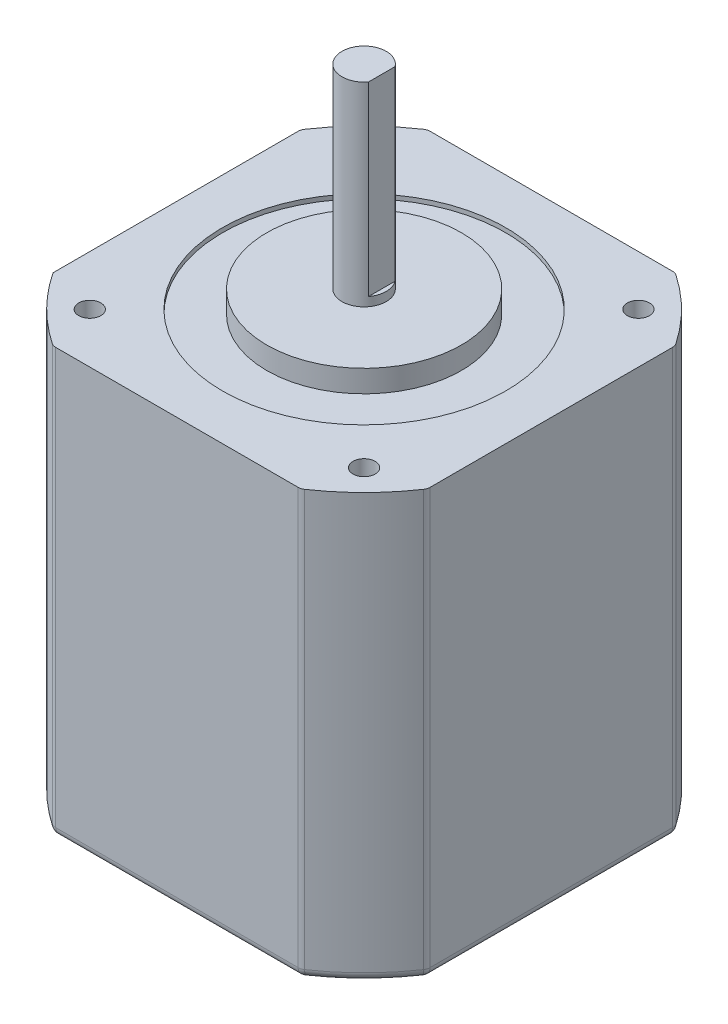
from build123d import *

# Parameters (mm, degrees)
BOSS_EXTRUDE1_DEPTH        = 48
SKETCH2_R                  = 11
BOSS_DEPTH                 = 2
SKETCH3_R                  = 2.5
SHAFT_DEPTH                = 22
SKETCH4_W                  = 0.5
SKETCH4_H                  = 3
SHAFT_FLAT_DEPTH           = 21
M3X0_5_TAPPED_HOLE1_D      = 2.5
M3X0_5_TAPPED_HOLE1_DEPTH  = 5.5
M3X0_5_TAPPED_HOLE1_TIP    = 0.751075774
MOUNTING_START             = -0.5
SKETCH7_R                  = 16
SKETCH7_R_2                = 11
MOUNTING_FACE_RELIEF_DEPTH = 0.5
FILLET1_R                  = 1


with BuildPart() as part:
    # Sketch1 → Boss-Extrude1 (new body)
    with BuildSketch(Plane(origin=(0, 0, 0), x_dir=(1, 0, 0), z_dir=(0, 1, 0))):
        with BuildLine():
            Line((21.15, -13.999732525), (21.15, 13.999732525))
            ThreePointArc((21.15, 13.999732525), (17.934812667, 17.934812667), (13.999732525, 21.15))
            Line((13.999732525, 21.15), (-13.999732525, 21.15))
            ThreePointArc((-13.999732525, 21.15), (-17.934812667, 17.934812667), (-21.15, 13.999732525))
            Line((-21.15, 13.999732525), (-21.15, -13.999732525))
            ThreePointArc((-21.15, -13.999732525), (-17.934812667, -17.934812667), (-13.999732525, -21.15))
            Line((-13.999732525, -21.15), (13.999732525, -21.15))
            ThreePointArc((13.999732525, -21.15), (17.934812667, -17.934812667), (21.15, -13.999732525))
        make_face()
    extrude(amount=BOSS_EXTRUDE1_DEPTH)

    # Sketch2 → boss (add)
    with BuildSketch(Plane(origin=(0, 48, 0), x_dir=(1, 0, 0), z_dir=(0, 1, 0))):
        with Locations(Location((0, 0, 0), (0, 0, 90))):
            Circle(SKETCH2_R)
    extrude(amount=BOSS_DEPTH)

    # Sketch3 → shaft (add)
    with BuildSketch(Plane(origin=(0, 50, 0), x_dir=(1, 0, 0), z_dir=(0, 1, 0))):
        with Locations(Location((0, 0, 0), (0, 0, 270))):
            Circle(SKETCH3_R)
    extrude(amount=SHAFT_DEPTH)

    # Sketch4 → shaft flat (cut)
    with BuildSketch(Plane(origin=(0, 72, 0), x_dir=(1, 0, 0), z_dir=(0, 1, 0))):
        with Locations((2.25, 0)):
            Rectangle(SKETCH4_W, SKETCH4_H)
    extrude(amount=-SHAFT_FLAT_DEPTH, mode=Mode.SUBTRACT)

    # M3x0.5 Tapped Hole1
    with Locations(Plane(origin=(0, 48, 0), x_dir=(1, 0, 0), z_dir=(0, 1, 0))):
        with Locations((-15.5, -15.5), (15.5, -15.5), (15.5, 15.5), (-15.5, 15.5)):
            Hole(M3X0_5_TAPPED_HOLE1_D / 2, depth=M3X0_5_TAPPED_HOLE1_DEPTH)
            with Locations((0, 0, -(M3X0_5_TAPPED_HOLE1_DEPTH + M3X0_5_TAPPED_HOLE1_TIP / 2))):  # 118° drill point
                Cone(0, M3X0_5_TAPPED_HOLE1_D / 2, M3X0_5_TAPPED_HOLE1_TIP, mode=Mode.SUBTRACT)

    # Sketch7 → mounting face relief (cut)
    with BuildSketch(Plane(origin=(0, 48, 0), x_dir=(1, 0, 0), z_dir=(0, 1, 0)).offset(MOUNTING_START)):
        with Locations(Location((0, 0, 0), (0, 0, 270))):
            Circle(SKETCH7_R)
        with Locations(Location((0, 0, 0), (0, 0, 270))):
            Circle(SKETCH7_R_2, mode=Mode.SUBTRACT)
    extrude(amount=MOUNTING_FACE_RELIEF_DEPTH, mode=Mode.SUBTRACT)

    # Fillet1
    fillet1_edges = [part.edges().sort_by_distance(p)[0] for p in [
        (0, 0, -21.15),
        (17.934812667, 0, -17.934812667),
        (21.15, 24, -13.999732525),
        (21.15, 24, 13.999732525),
        (13.999732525, 24, 21.15),
        (-13.999732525, 24, 21.15),
        (-21.15, 24, -13.999732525),
        (-13.999732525, 24, -21.15),
        (13.999732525, 24, -21.15),
        (21.15, 0, 0),
        (17.934812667, 0, 17.934812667),
        (0, 0, 21.15),
        (-17.934812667, 0, 17.934812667),
        (-21.15, 0, 0),
        (-17.934812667, 0, -17.934812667),
    ]]
    fillet(fillet1_edges, radius=FILLET1_R)


solid = part.part
